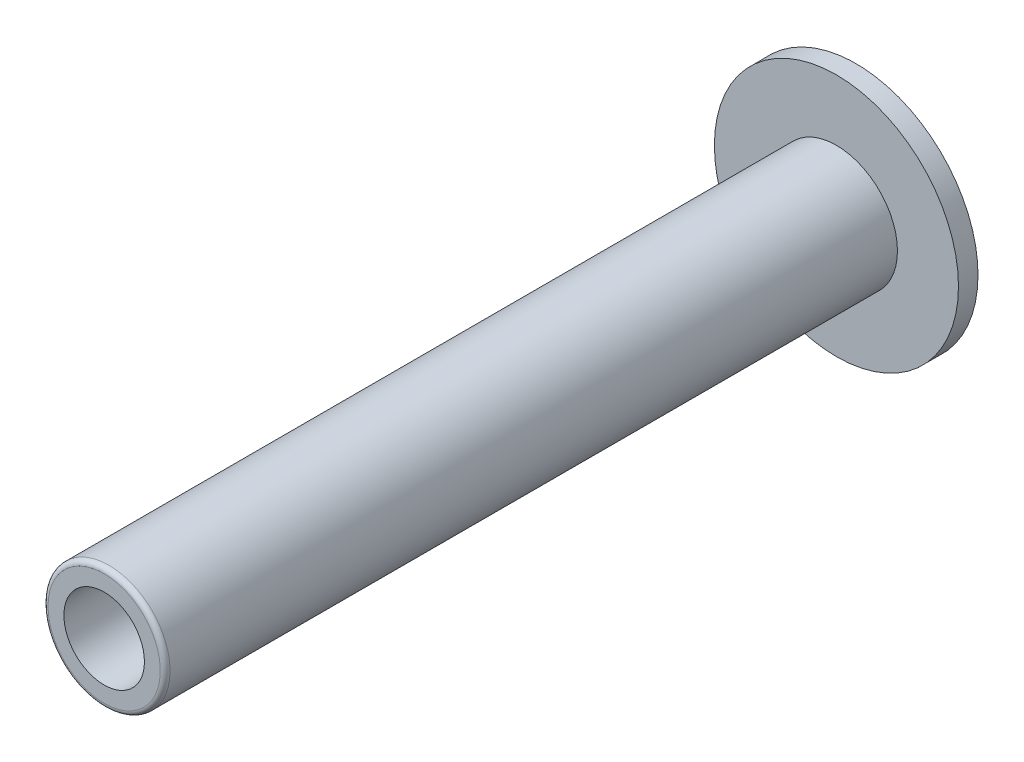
from build123d import *

# Parameters (mm, degrees)
CONG_1_R                = 0.2
ENL_V_MAT_EXTRU_1_DEPTH = 1
TROU_TARAUD_M41_D       = 3.3
TROU_TARAUD_M41_DEPTH   = 20
TROU_TARAUD_M41_TIP     = 0.991420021


with BuildPart() as part:
    # Esquisse1 → R_volution1 (revolve)
    with BuildSketch(Plane(origin=(0, 0, 0), x_dir=(0, 0, -1), z_dir=(1, 0, 0)), mode=Mode.PRIVATE) as r_volution1_sk:
        with BuildLine():
            Line((0, 2.5), (0, 5))
            Line((0, 5), (0.8, 5))
            ThreePointArc((0.8, 5), (1.843396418, 2.596150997), (2.2, 0))
            Line((2.2, 0), (-30, 0))
            Line((-30, 0), (-30, 2.5))
            Line((-30, 2.5), (0, 2.5))
        make_face()
    revolve(r_volution1_sk.sketch.rotate(Axis((0, 0, 35.407514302), (0, 0, -1)), 90), axis=Axis((0, 0, 35.407514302), (0, 0, -1)))

    # Cong_1
    cong_1_edges = [part.edges().sort_by_distance(p)[0] for p in [
        (-2.5, 0, 30),
    ]]
    fillet(cong_1_edges, radius=CONG_1_R)

    # Esquisse2 → Enl_v. mat.-Extru.1 (cut)
    with BuildSketch(Plane(origin=(0, 0, -2.2), x_dir=(-1, 0, 0), z_dir=(0, 0, -1))):
        Polygon((0.5, 0.5), (6, 0.5), (6, -0.5), (0.5, -0.5), (0.5, -2), (-0.5, -2), (-0.5, -0.5), (-6, -0.5), (-6, 0.5), (-0.5, 0.5), (-0.5, 2), (0.5, 2), align=None)
    extrude(amount=-ENL_V_MAT_EXTRU_1_DEPTH, mode=Mode.SUBTRACT)

    # Trou taraud_ M41
    with Locations(Plane.XY.offset(30)):
        with Locations((0, 0)):
            Hole(TROU_TARAUD_M41_D / 2, depth=TROU_TARAUD_M41_DEPTH)
            with Locations((0, 0, -(TROU_TARAUD_M41_DEPTH + TROU_TARAUD_M41_TIP / 2))):  # 118° drill point
                Cone(0, TROU_TARAUD_M41_D / 2, TROU_TARAUD_M41_TIP, mode=Mode.SUBTRACT)


solid = part.part
